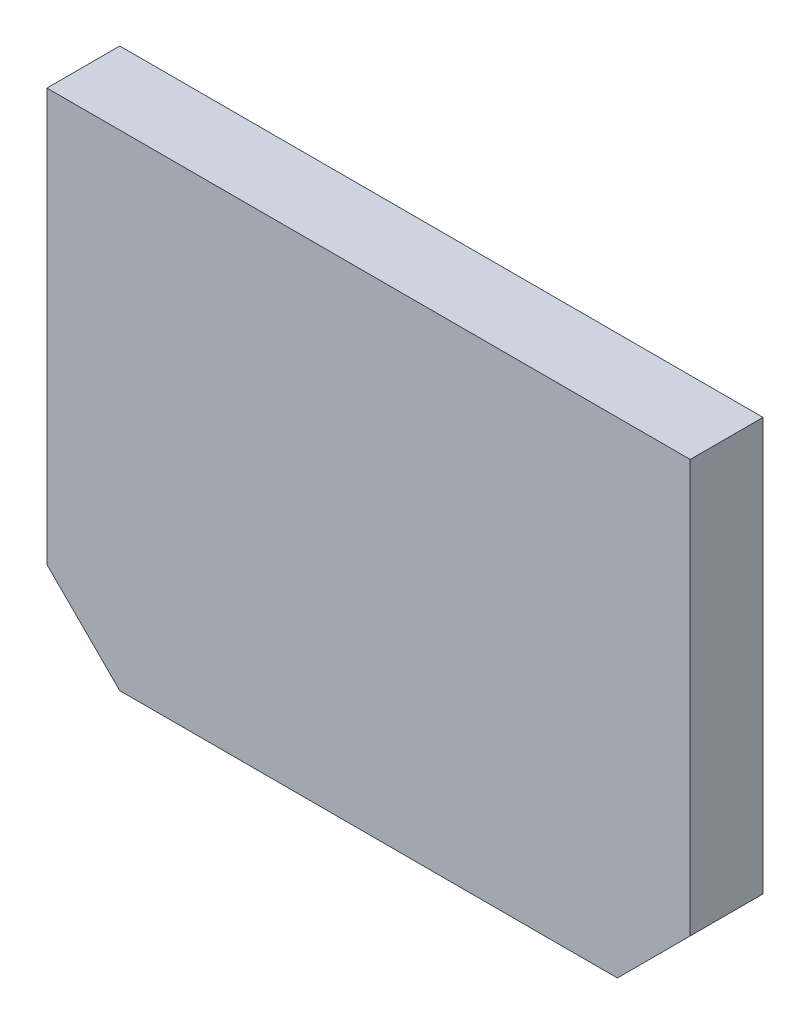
from build123d import *

# Parameters (mm, degrees)
SKETCH_1_W      = 53
SKETCH_1_H      = 40
EXTRUDE_1_DEPTH = 6
CHAMFER_1_SIZE  = 6


with BuildPart() as part:
    # Sketch 1 → Extrude 1 (new body)
    with BuildSketch(Plane.XY):
        with Locations((26.5, 20)):
            Rectangle(SKETCH_1_W, SKETCH_1_H)
    extrude(amount=EXTRUDE_1_DEPTH)

    # Chamfer 1
    chamfer_1_edges = [part.edges().sort_by_distance(p)[0] for p in [
        (53, 0, 3),
        (0, 0, 3),
    ]]
    chamfer(chamfer_1_edges, length=CHAMFER_1_SIZE)


solid = part.part
